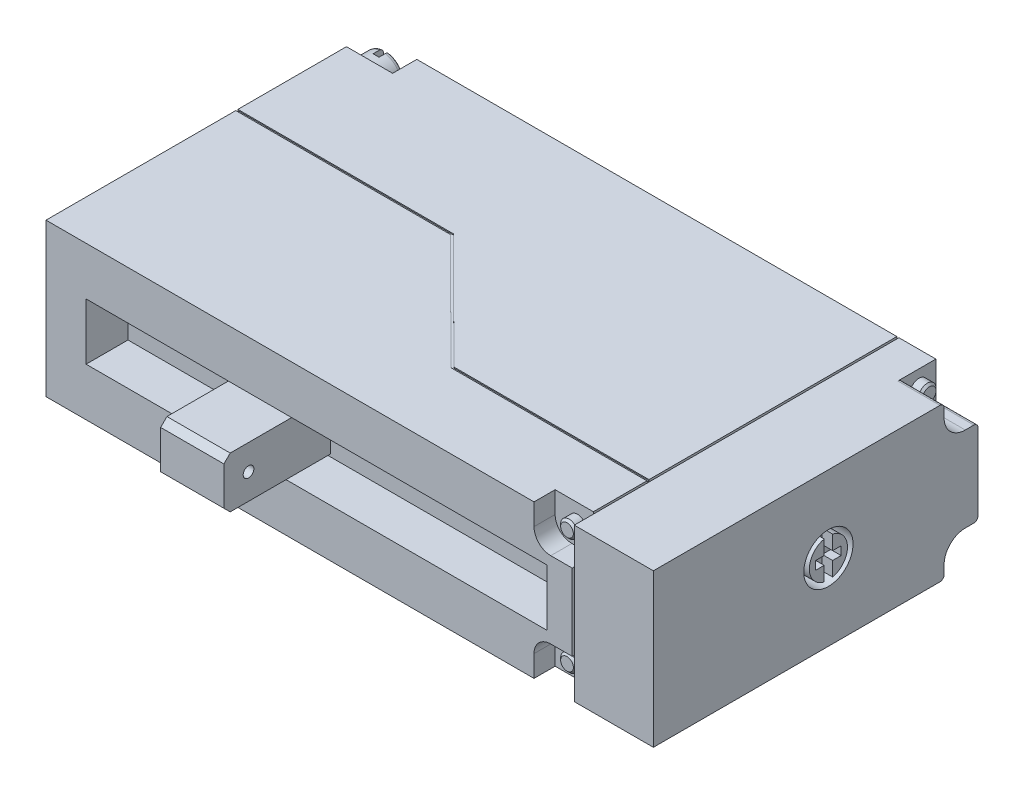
from build123d import *

# Parameters (mm, degrees)
SKETCH1_W               = 29
SKETCH1_H               = 7.3
BOSS_EXTRUDE1_DEPTH     = 15.5
SKETCH2_W               = 22
SKETCH2_H               = 2.7
CUT_EXTRUDE1_DEPTH      = 2
SKETCH3_W               = 3.0201
SKETCH3_H               = 2.4341
BOSS_EXTRUDE2_DEPTH     = 5.1
CHAMFER1_SIZE           = 0.3
SKETCH7_R               = 0.254202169
CUT_EXTRUDE2_DEPTH      = 26.734176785
CUT_EXTRUDE3_DEPTH      = 2.0116
FILLET1_R               = 0.2
SKETCH9_R               = 0.418927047
BOSS_EXTRUDE3_DEPTH     = 0.5018
CHAMFER2_SIZE           = 0.1
CUT_EXTRUDE4_DEPTH      = 0.05
CUT_EXTRUDE4_DEPTH_BACK = 0.05
CUT_EXTRUDE5_DEPTH      = 0.05
SKETCH12_W              = 0.1
SKETCH12_H              = 7.3
CUT_EXTRUDE6_DEPTH      = 0.05
CUT_EXTRUDE7_DEPTH      = 0.05
CUT_EXTRUDE8_DEPTH      = 1.1539
SKETCH15_R              = 0.904437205
BOSS_EXTRUDE4_DEPTH     = 0.9019
FILLET2_R               = 0.2
SKETCH16_W              = 0.2841
SKETCH16_H              = 2.515409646
SKETCH16_W_2            = 0.283325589
SKETCH16_H_2            = 2.17222661
CUT_EXTRUDE9_DEPTH      = 0.5014
CUT_EXTRUDE10_DEPTH     = 1.0089
SKETCH18_R              = 0.4035
BOSS_EXTRUDE5_DEPTH     = 0.5018
CHAMFER3_SIZE           = 0.1
SKETCH19_R              = 1.175482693
CUT_EXTRUDE11_DEPTH     = 1
SKETCH20_R              = 0.911182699
BOSS_EXTRUDE6_DEPTH     = 1
CUT_EXTRUDE12_DEPTH     = 0.5
SKETCH22_R              = 0.50045
BOSS_EXTRUDE7_DEPTH     = 0.2024
CHAMFER4_SIZE           = 0.1


with BuildPart() as part:
    # Sketch1 → Boss-Extrude1 (new body)
    with BuildSketch(Plane.XY):
        Rectangle(SKETCH1_W, SKETCH1_H)
    extrude(amount=BOSS_EXTRUDE1_DEPTH)

    # Sketch2 → Cut-Extrude1 (cut)
    with BuildSketch(Plane.XY.offset(15.5)):
        with Locations((-1.58570087, 0)):
            Rectangle(SKETCH2_W, SKETCH2_H)
    extrude(amount=-CUT_EXTRUDE1_DEPTH, mode=Mode.SUBTRACT)

    # Sketch3 → Boss-Extrude2 (add)
    with BuildSketch(Plane.XY.offset(13.5)):
        with Locations((-4.41595, -0.00105)):
            Rectangle(SKETCH3_W, SKETCH3_H)
    extrude(amount=BOSS_EXTRUDE2_DEPTH)

    # Chamfer1
    chamfer1_edges = [part.edges().sort_by_distance(p)[0] for p in [
        (-4.41595, 1.216, 18.6),
        (-4.41595, -1.2181, 18.6),
    ]]
    chamfer(chamfer1_edges, length=CHAMFER1_SIZE)

    # Sketch7 → Cut-Extrude2 (cut, through all)
    with BuildSketch(Plane(origin=(-2.9059, 0, 0), x_dir=(0, 0, -1), z_dir=(1, 0, 0))):
        with Locations((-17.4241, -0.00095)):
            Circle(SKETCH7_R)
    extrude(amount=-CUT_EXTRUDE2_DEPTH, mode=Mode.SUBTRACT)

    # Sketch8 → Cut-Extrude3 (cut)
    with BuildSketch(Plane(origin=(14.5, 0, 0), x_dir=(0, 0, -1), z_dir=(1, 0, 0))):
        with BuildLine():
            Line((-0.6087, -2.0286), (0.232615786, -2.0286))
            Line((0.232615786, -2.0286), (0.232615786, -3.815882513))
            Line((0.232615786, -3.815882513), (-1.6174, -3.815882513))
            Line((-1.6174, -3.815882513), (-1.6174, -2.9632))
            ThreePointArc((-1.6174, -2.9632), (-1.295858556, -2.298597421), (-0.6087, -2.0286))
        make_face()
        with BuildLine():
            Line((-0.6087, 2.0264), (0.232615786, 2.0264))
            Line((0.232615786, 2.0264), (0.232615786, 3.813682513))
            Line((0.232615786, 3.813682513), (-1.6174, 3.813682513))
            Line((-1.6174, 3.813682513), (-1.6174, 2.961))
            ThreePointArc((-1.6174, 2.961), (-1.295858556, 2.296397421), (-0.6087, 2.0264))
        make_face()
    extrude(amount=-CUT_EXTRUDE3_DEPTH, mode=Mode.SUBTRACT)

    # Fillet1
    fillet1_edges = [part.edges().sort_by_distance(p)[0] for p in [
        (13.4942, -2.0286, 0),
        (13.4942, -3.65, 1.6174),
        (13.4942, 2.0264, 0),
        (13.4942, 3.65, 1.6174),
    ]]
    fillet(fillet1_edges, radius=FILLET1_R)

    # Sketch9 → Boss-Extrude3 (add)
    with BuildSketch(Plane(origin=(12.4884, 0, 0), x_dir=(0, 0, -1), z_dir=(1, 0, 0))):
        with Locations(Location((-0.8111, -2.8415, 0), (0, 0, 180))):
            Circle(SKETCH9_R)
        with Locations((-0.8111, 2.839340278)):
            Circle(SKETCH9_R)
    extrude(amount=BOSS_EXTRUDE3_DEPTH)

    # Chamfer2
    chamfer2_edges = [part.edges().sort_by_distance(p)[0] for p in [
        (12.9902, -2.8415, 0.392172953),
        (12.9902, 2.839340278, 1.230027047),
    ]]
    chamfer(chamfer2_edges, length=CHAMFER2_SIZE)

    # Sketch10 → Cut-Extrude4 (cut, two sides: drawn at the far end of the back side and taken through both)
    with BuildSketch(Plane(origin=(10.6752, 0, 0), x_dir=(0, 0, -1), z_dir=(1, 0, 0)).offset(-CUT_EXTRUDE4_DEPTH_BACK)):
        Polygon((-11.884, -3.6522), (0, -3.6522), (0, 3.65), (-11.884, 3.65), (-15.2939, 3.65), (-15.4944, 3.65), (-15.550895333, 3.65), (-15.550895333, -3.6522), (-15.496463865, -3.6522), (-15.4944, -3.6522), (-15.2939, -3.6522), align=None)
        Polygon((-11.884, -3.5522), (-0.1, -3.5522), (-0.1, 3.55), (-11.884, 3.55), (-15.2939, 3.55), (-15.3944, 3.55), (-15.3944, -3.5522), (-15.2939, -3.5522), align=None, mode=Mode.SUBTRACT)
    extrude(amount=CUT_EXTRUDE4_DEPTH + CUT_EXTRUDE4_DEPTH_BACK, mode=Mode.SUBTRACT)

    # Sketch11 → Cut-Extrude5 (cut)
    with BuildSketch(Plane(origin=(0, 3.65, 0), x_dir=(1, 0, 0), z_dir=(0, 1, 0))):
        Polygon((10.6752, -11.834), (1.311244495, -11.834), (-4.208355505, -6.3393), (-13.997, -6.3393), (-14.5013, -6.3393), (-14.5013, -6.4393), (-13.997, -6.4393), (-4.249644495, -6.4393), (1.269955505, -11.934), (10.6752, -11.934), align=None)
    extrude(amount=-CUT_EXTRUDE5_DEPTH, mode=Mode.SUBTRACT)

    # Sketch12 → Cut-Extrude6 (cut)
    with BuildSketch(Plane.ZY.offset(14.5)):
        with Locations((6.3893, 0)):
            Rectangle(SKETCH12_W, SKETCH12_H)
    extrude(amount=-CUT_EXTRUDE6_DEPTH, mode=Mode.SUBTRACT)

    # Sketch13 → Cut-Extrude7 (cut)
    with BuildSketch(Plane.XZ.offset(3.65)):
        Polygon((-14.5013, 6.3393), (-13.997, 6.3393), (-4.208355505, 6.3393), (1.311244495, 11.834), (10.6752, 11.834), (10.6752, 11.934), (1.269955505, 11.934), (-4.249644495, 6.4393), (-13.997, 6.4393), (-14.5013, 6.4393), align=None)
    extrude(amount=-CUT_EXTRUDE7_DEPTH, mode=Mode.SUBTRACT)

    # Sketch14 → Cut-Extrude8 (cut)
    with BuildSketch(Plane(origin=(0, 0, 0), x_dir=(-1, 0, 0), z_dir=(0, 0, -1))):
        with BuildLine():
            Line((12.29535, 3.65), (14.5, 3.65))
            Line((14.5, 3.65), (14.5, 1.44535))
            Line((14.5, 1.44535), (13.49535, 1.44535))
            ThreePointArc((13.49535, 1.44535), (12.646821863, 1.796821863), (12.29535, 2.64535))
            Line((12.29535, 2.64535), (12.29535, 3.65))
        make_face()
        with BuildLine():
            Line((14.5, -3.65), (14.5, -1.44535))
            Line((14.5, -1.44535), (13.49535, -1.44535))
            ThreePointArc((13.49535, -1.44535), (12.646821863, -1.796821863), (12.29535, -2.64535))
            Line((12.29535, -2.64535), (12.29535, -3.65))
            Line((12.29535, -3.65), (14.5, -3.65))
        make_face()
    extrude(amount=-CUT_EXTRUDE8_DEPTH, mode=Mode.SUBTRACT)

    # Sketch15 → Boss-Extrude4 (add)
    with BuildSketch(Plane(origin=(0, 0, 1.1539), x_dir=(-1, 0, 0), z_dir=(0, 0, -1))):
        with Locations((13.494962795, 2.690054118)):
            Circle(SKETCH15_R)
        with Locations(Location((13.494962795, -2.690054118, 0), (0, 0, 180))):
            Circle(SKETCH15_R)
    extrude(amount=BOSS_EXTRUDE4_DEPTH)

    # Fillet2
    fillet2_edges = [part.edges().sort_by_distance(p)[0] for p in [
        (-12.590525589, 2.690054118, 0.252),
        (-14.3994, -2.690054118, 0.252),
    ]]
    fillet(fillet2_edges, radius=FILLET2_R)

    # Sketch16 → Cut-Extrude9 (cut)
    with BuildSketch(Plane(origin=(0, 0, 0.252), x_dir=(-1, 0, 0), z_dir=(0, 0, -1))):
        with Locations((13.49535, 2.64535)):
            Rectangle(SKETCH16_W, SKETCH16_H)
        with Locations((13.494962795, -2.690054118)):
            Rectangle(SKETCH16_W_2, SKETCH16_H_2)
    extrude(amount=-CUT_EXTRUDE9_DEPTH, mode=Mode.SUBTRACT)

    # Sketch17 → Cut-Extrude10 (cut)
    with BuildSketch(Plane.XY.offset(15.5)):
        with BuildLine():
            Line((10.6252, 3.65), (8.8006, 3.65))
            Line((8.8006, 3.65), (8.8006, 2.6254))
            ThreePointArc((8.8006, 2.6254), (9.034914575, 2.059714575), (9.6006, 1.8254))
            Line((9.6006, 1.8254), (10.6252, 1.8254))
            Line((10.6252, 1.8254), (10.6252, 3.65))
        make_face()
        with BuildLine():
            Line((8.8006, -3.65), (8.8006, -2.6254))
            ThreePointArc((8.8006, -2.6254), (9.034914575, -2.059714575), (9.6006, -1.8254))
            Line((9.6006, -1.8254), (10.6252, -1.8254))
            Line((10.6252, -1.8254), (10.6252, -3.65))
            Line((10.6252, -3.65), (8.8006, -3.65))
        make_face()
    extrude(amount=-CUT_EXTRUDE10_DEPTH, mode=Mode.SUBTRACT)

    # Sketch18 → Boss-Extrude5 (add)
    with BuildSketch(Plane.XY.offset(14.4911)):
        with Locations(Location((9.8693, 2.765862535, 0), (0, 0, 180))):
            Circle(SKETCH18_R)
        with Locations(Location((9.8693, -2.765862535, 0), (0, 0, 180))):
            Circle(SKETCH18_R)
    extrude(amount=BOSS_EXTRUDE5_DEPTH)

    # Chamfer3
    chamfer3_edges = [part.edges().sort_by_distance(p)[0] for p in [
        (10.2728, 2.765862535, 14.9929),
        (10.2728, -2.765862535, 14.9929),
    ]]
    chamfer(chamfer3_edges, length=CHAMFER3_SIZE)

    # Sketch19 → Cut-Extrude11 (cut)
    with BuildSketch(Plane(origin=(14.5, 0, 0), x_dir=(0, 0, -1), z_dir=(1, 0, 0))):
        with Locations((-7.142975, 0.0001)):
            Circle(SKETCH19_R)
    extrude(amount=-CUT_EXTRUDE11_DEPTH, mode=Mode.SUBTRACT)

    # Sketch20 → Boss-Extrude6 (add)
    with BuildSketch(Plane(origin=(13.5, 0, 0), x_dir=(0, 0, -1), z_dir=(1, 0, 0))):
        with Locations((-7.142975, 0.0001)):
            Circle(SKETCH20_R)
    extrude(amount=BOSS_EXTRUDE6_DEPTH)

    # Sketch21 → Cut-Extrude12 (cut)
    with BuildSketch(Plane(origin=(14.5, 0, 0), x_dir=(0, 0, -1), z_dir=(1, 0, 0))):
        Polygon((-7.3439, -1.003220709), (-6.9397, -1.003220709), (-6.9397, -0.2024), (-6.5352, -0.2024), (-6.5352, 0.2026), (-6.9397, 0.2026), (-6.9397, 0.965638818), (-7.3439, 0.965638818), (-7.3439, 0.2026), (-7.7508, 0.2026), (-7.7508, -0.2024), (-7.3439, -0.2024), align=None)
    extrude(amount=-CUT_EXTRUDE12_DEPTH, mode=Mode.SUBTRACT)

    # Sketch22 → Boss-Extrude7 (add)
    with BuildSketch(Plane.ZY.offset(14.5)):
        with Locations(Location((11.88515, 0, 0), (0, 0, 180))):
            Circle(SKETCH22_R)
    extrude(amount=BOSS_EXTRUDE7_DEPTH)

    # Chamfer4
    chamfer4_edges = [part.edges().sort_by_distance(p)[0] for p in [
        (-14.7024, 0, 12.3856),
    ]]
    chamfer(chamfer4_edges, length=CHAMFER4_SIZE)


solid = part.part
